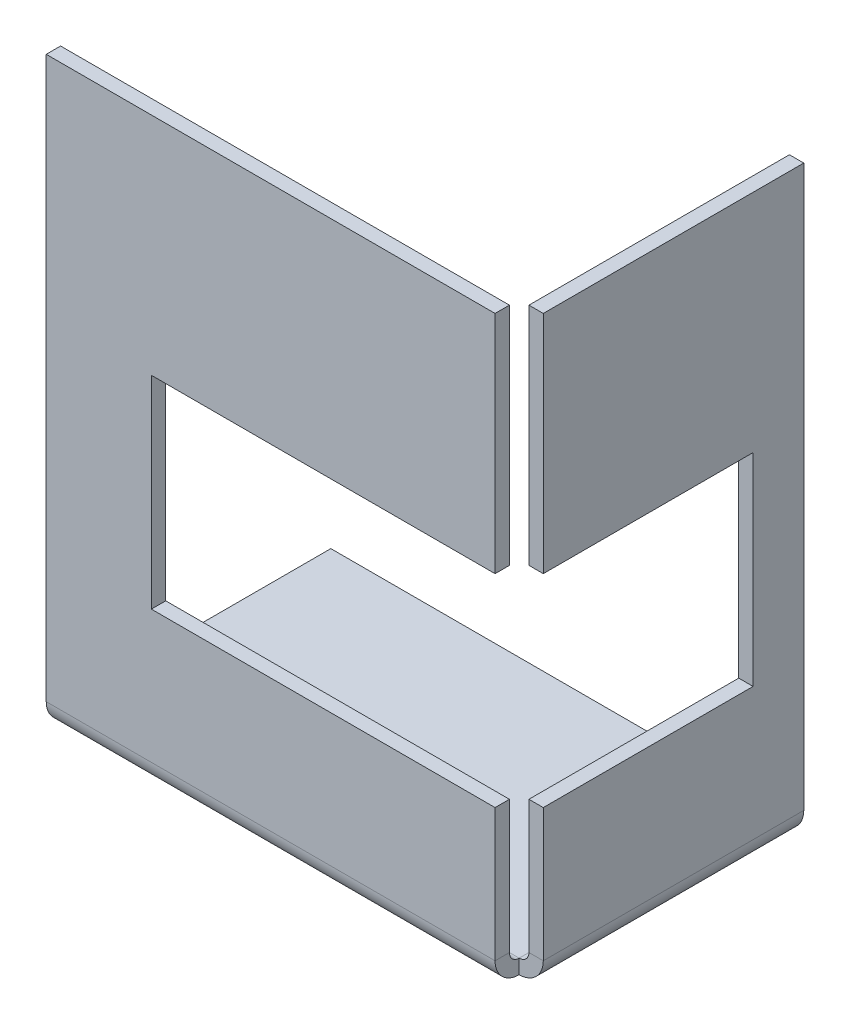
ISO-10303-21;
HEADER;
FILE_DESCRIPTION(('STEP AP214'),'2;1');
FILE_NAME('part.step','',(''),(''),'','','');
FILE_SCHEMA(('AUTOMOTIVE_DESIGN { 1 0 10303 214 1 1 1 1 }'));
ENDSEC;
DATA;
#1=APPLICATION_CONTEXT('core data for automotive mechanical design processes');
#2=APPLICATION_PROTOCOL_DEFINITION('international standard','automotive_design',2000,#1);
#3=PRODUCT_CONTEXT('',#1,'mechanical');
#4=PRODUCT('Part','Part','',(#3));
#5=PRODUCT_RELATED_PRODUCT_CATEGORY('part','',(#4));
#6=PRODUCT_DEFINITION_FORMATION('','',#4);
#7=PRODUCT_DEFINITION_CONTEXT('part definition',#1,'design');
#8=PRODUCT_DEFINITION('design','',#6,#7);
#9=PRODUCT_DEFINITION_SHAPE('','',#8);
#10=(LENGTH_UNIT() NAMED_UNIT(*) SI_UNIT(.MILLI.,.METRE.));
#11=(NAMED_UNIT(*) PLANE_ANGLE_UNIT() SI_UNIT($,.RADIAN.));
#12=(NAMED_UNIT(*) SI_UNIT($,.STERADIAN.) SOLID_ANGLE_UNIT());
#13=UNCERTAINTY_MEASURE_WITH_UNIT(LENGTH_MEASURE(1.E-05),#10,'distance_accuracy_value','');
#14=(GEOMETRIC_REPRESENTATION_CONTEXT(3) GLOBAL_UNCERTAINTY_ASSIGNED_CONTEXT((#13)) GLOBAL_UNIT_ASSIGNED_CONTEXT((#10,
#11,#12)) REPRESENTATION_CONTEXT('',''));
#15=CARTESIAN_POINT('',(0.,0.,0.));
#16=DIRECTION('',(0.,0.,1.));
#17=DIRECTION('',(1.,0.,0.));
#18=AXIS2_PLACEMENT_3D('',#15,#16,#17);
#19=CARTESIAN_POINT('',(23.0274150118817,29.2634,1.2366));
#20=DIRECTION('',(-1.,0.,0.));
#21=DIRECTION('',(0.,0.,1.));
#22=AXIS2_PLACEMENT_3D('',#19,#20,#21);
#23=PLANE('',#22);
#24=DIRECTION('',(0.,1.,0.));
#25=VECTOR('',#24,1.);
#26=CARTESIAN_POINT('',(23.0274150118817,29.2634,1.2366));
#27=LINE('',#26,#25);
#28=CARTESIAN_POINT('',(23.0274150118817,17.6997626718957,1.2366));
#29=VERTEX_POINT('',#28);
#30=CARTESIAN_POINT('',(23.0274150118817,29.2634,1.2366));
#31=VERTEX_POINT('',#30);
#32=EDGE_CURVE('E237',#29,#31,#27,.T.);
#33=ORIENTED_EDGE('',*,*,#32,.F.);
#34=DIRECTION('',(0.,0.,-1.));
#35=VECTOR('',#34,1.);
#36=CARTESIAN_POINT('',(23.0274150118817,17.6997626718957,1.2366));
#37=LINE('',#36,#35);
#38=CARTESIAN_POINT('',(23.0274150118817,17.6997626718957,0.499999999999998));
#39=VERTEX_POINT('',#38);
#40=EDGE_CURVE('E261',#29,#39,#37,.T.);
#41=ORIENTED_EDGE('',*,*,#40,.T.);
#42=DIRECTION('',(0.,-1.,0.));
#43=VECTOR('',#42,1.);
#44=CARTESIAN_POINT('',(23.0274150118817,29.2634,0.499999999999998));
#45=LINE('',#44,#43);
#46=CARTESIAN_POINT('',(23.0274150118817,29.2634,0.499999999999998));
#47=VERTEX_POINT('',#46);
#48=EDGE_CURVE('E248',#39,#47,#45,.F.);
#49=ORIENTED_EDGE('',*,*,#48,.T.);
#50=DIRECTION('',(0.,0.,-1.));
#51=VECTOR('',#50,1.);
#52=CARTESIAN_POINT('',(23.0274150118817,29.2634,1.2366));
#53=LINE('',#52,#51);
#54=EDGE_CURVE('E275',#31,#47,#53,.T.);
#55=ORIENTED_EDGE('',*,*,#54,.F.);
#56=EDGE_LOOP('',(#33,#41,#49,#55));
#57=FACE_BOUND('',#56,.T.);
#58=ADVANCED_FACE('F74',(#57),#23,.F.);
#59=CARTESIAN_POINT('',(24.2640150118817,0.,0.));
#60=DIRECTION('',(0.,0.,-1.));
#61=DIRECTION('',(-1.,0.,0.));
#62=AXIS2_PLACEMENT_3D('',#59,#60,#61);
#63=PLANE('',#62);
#64=DIRECTION('',(0.,-1.,0.));
#65=VECTOR('',#64,1.);
#66=CARTESIAN_POINT('',(24.2640150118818,29.2634,0.));
#67=LINE('',#66,#65);
#68=CARTESIAN_POINT('',(24.2640150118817,7.30900522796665,0.));
#69=VERTEX_POINT('',#68);
#70=CARTESIAN_POINT('',(24.2640150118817,0.499999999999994,0.));
#71=VERTEX_POINT('',#70);
#72=EDGE_CURVE('E314',#69,#71,#67,.T.);
#73=ORIENTED_EDGE('',*,*,#72,.F.);
#74=DIRECTION('',(-1.,0.,0.));
#75=VECTOR('',#74,1.);
#76=CARTESIAN_POINT('',(33.5274150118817,7.30900522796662,0.));
#77=LINE('',#76,#75);
#78=CARTESIAN_POINT('',(23.5274150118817,7.30900522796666,0.));
#79=VERTEX_POINT('',#78);
#80=EDGE_CURVE('E282',#69,#79,#77,.T.);
#81=ORIENTED_EDGE('',*,*,#80,.T.);
#82=DIRECTION('',(0.,1.,0.));
#83=VECTOR('',#82,1.);
#84=CARTESIAN_POINT('',(23.5274150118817,0.,0.));
#85=LINE('',#84,#83);
#86=CARTESIAN_POINT('',(23.5274150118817,0.499999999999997,0.));
#87=VERTEX_POINT('',#86);
#88=EDGE_CURVE('E322',#79,#87,#85,.F.);
#89=ORIENTED_EDGE('',*,*,#88,.T.);
#90=DIRECTION('',(-1.,0.,0.));
#91=VECTOR('',#90,1.);
#92=CARTESIAN_POINT('',(24.2640150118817,0.499999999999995,0.));
#93=LINE('',#92,#91);
#94=EDGE_CURVE('E299',#87,#71,#93,.F.);
#95=ORIENTED_EDGE('',*,*,#94,.T.);
#96=EDGE_LOOP('',(#73,#81,#89,#95));
#97=FACE_BOUND('',#96,.T.);
#98=ADVANCED_FACE('F469',(#97),#63,.F.);
#99=CARTESIAN_POINT('',(0.,-0.7366,0.));
#100=DIRECTION('',(-1.,0.,0.));
#101=DIRECTION('',(0.,0.,1.));
#102=AXIS2_PLACEMENT_3D('',#99,#100,#101);
#103=PLANE('',#102);
#104=DIRECTION('',(0.,0.,1.));
#105=VECTOR('',#104,1.);
#106=CARTESIAN_POINT('',(0.,0.,0.));
#107=LINE('',#106,#105);
#108=CARTESIAN_POINT('',(0.,0.,-13.364473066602));
#109=VERTEX_POINT('',#108);
#110=CARTESIAN_POINT('',(0.,0.,0.));
#111=VERTEX_POINT('',#110);
#112=EDGE_CURVE('E336',#109,#111,#107,.T.);
#113=ORIENTED_EDGE('',*,*,#112,.F.);
#114=DIRECTION('',(0.,1.,0.));
#115=VECTOR('',#114,1.);
#116=CARTESIAN_POINT('',(0.,-0.7366,-13.364473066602));
#117=LINE('',#116,#115);
#118=CARTESIAN_POINT('',(0.,-0.7366,-13.364473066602));
#119=VERTEX_POINT('',#118);
#120=EDGE_CURVE('E13',#119,#109,#117,.T.);
#121=ORIENTED_EDGE('',*,*,#120,.F.);
#122=DIRECTION('',(0.,0.,1.));
#123=VECTOR('',#122,1.);
#124=CARTESIAN_POINT('',(0.,-0.7366,0.));
#125=LINE('',#124,#123);
#126=CARTESIAN_POINT('',(0.,-0.7366,0.));
#127=VERTEX_POINT('',#126);
#128=EDGE_CURVE('E345',#119,#127,#125,.T.);
#129=ORIENTED_EDGE('',*,*,#128,.T.);
#130=DIRECTION('',(0.,1.,0.));
#131=VECTOR('',#130,1.);
#132=CARTESIAN_POINT('',(0.,-0.7366,0.));
#133=LINE('',#132,#131);
#134=EDGE_CURVE('E78',#127,#111,#133,.T.);
#135=ORIENTED_EDGE('',*,*,#134,.T.);
#136=EDGE_LOOP('',(#113,#121,#129,#135));
#137=FACE_BOUND('',#136,.T.);
#138=ADVANCED_FACE('F76',(#137),#103,.T.);
#139=CARTESIAN_POINT('',(0.,-0.7366,-13.364473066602));
#140=DIRECTION('',(0.,0.,-1.));
#141=DIRECTION('',(-1.,0.,0.));
#142=AXIS2_PLACEMENT_3D('',#139,#140,#141);
#143=PLANE('',#142);
#144=DIRECTION('',(-1.,0.,0.));
#145=VECTOR('',#144,1.);
#146=CARTESIAN_POINT('',(0.,0.,-13.364473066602));
#147=LINE('',#146,#145);
#148=CARTESIAN_POINT('',(23.0274150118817,0.,-13.364473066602));
#149=VERTEX_POINT('',#148);
#150=EDGE_CURVE('E349',#149,#109,#147,.T.);
#151=ORIENTED_EDGE('',*,*,#150,.F.);
#152=DIRECTION('',(0.,1.,0.));
#153=VECTOR('',#152,1.);
#154=CARTESIAN_POINT('',(23.0274150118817,-0.7366,-13.364473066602));
#155=LINE('',#154,#153);
#156=CARTESIAN_POINT('',(23.0274150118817,-0.736600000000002,-13.364473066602));
#157=VERTEX_POINT('',#156);
#158=EDGE_CURVE('E83',#157,#149,#155,.T.);
#159=ORIENTED_EDGE('',*,*,#158,.F.);
#160=DIRECTION('',(-1.,0.,0.));
#161=VECTOR('',#160,1.);
#162=CARTESIAN_POINT('',(0.,-0.7366,-13.364473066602));
#163=LINE('',#162,#161);
#164=EDGE_CURVE('E355',#157,#119,#163,.T.);
#165=ORIENTED_EDGE('',*,*,#164,.T.);
#166=ORIENTED_EDGE('',*,*,#120,.T.);
#167=EDGE_LOOP('',(#151,#159,#165,#166));
#168=FACE_BOUND('',#167,.T.);
#169=ADVANCED_FACE('F725',(#168),#143,.T.);
#170=CARTESIAN_POINT('',(0.,-0.7366,-13.364473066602));
#171=DIRECTION('',(0.,-1.,0.));
#172=DIRECTION('',(0.,0.,-1.));
#173=AXIS2_PLACEMENT_3D('',#170,#171,#172);
#174=PLANE('',#173);
#175=ORIENTED_EDGE('',*,*,#128,.F.);
#176=ORIENTED_EDGE('',*,*,#164,.F.);
#177=DIRECTION('',(0.,0.,-1.));
#178=VECTOR('',#177,1.);
#179=CARTESIAN_POINT('',(23.0274150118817,-0.7366,0.));
#180=LINE('',#179,#178);
#181=CARTESIAN_POINT('',(23.0274150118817,-0.7366,0.));
#182=VERTEX_POINT('',#181);
#183=EDGE_CURVE('E352',#182,#157,#180,.T.);
#184=ORIENTED_EDGE('',*,*,#183,.F.);
#185=DIRECTION('',(1.,0.,0.));
#186=VECTOR('',#185,1.);
#187=CARTESIAN_POINT('',(0.,-0.7366,0.));
#188=LINE('',#187,#186);
#189=EDGE_CURVE('E348',#127,#182,#188,.T.);
#190=ORIENTED_EDGE('',*,*,#189,.F.);
#191=EDGE_LOOP('',(#175,#176,#184,#190));
#192=FACE_BOUND('',#191,.T.);
#193=ADVANCED_FACE('F432',(#192),#174,.T.);
#194=CARTESIAN_POINT('',(0.,0.,-13.364473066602));
#195=DIRECTION('',(0.,-1.,0.));
#196=DIRECTION('',(0.,0.,-1.));
#197=AXIS2_PLACEMENT_3D('',#194,#195,#196);
#198=PLANE('',#197);
#199=ORIENTED_EDGE('',*,*,#112,.T.);
#200=DIRECTION('',(1.,0.,0.));
#201=VECTOR('',#200,1.);
#202=CARTESIAN_POINT('',(0.,0.,0.));
#203=LINE('',#202,#201);
#204=CARTESIAN_POINT('',(23.0274150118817,0.,0.));
#205=VERTEX_POINT('',#204);
#206=EDGE_CURVE('E360',#111,#205,#203,.T.);
#207=ORIENTED_EDGE('',*,*,#206,.T.);
#208=DIRECTION('',(0.,0.,-1.));
#209=VECTOR('',#208,1.);
#210=CARTESIAN_POINT('',(23.0274150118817,0.,0.));
#211=LINE('',#210,#209);
#212=EDGE_CURVE('E362',#205,#149,#211,.T.);
#213=ORIENTED_EDGE('',*,*,#212,.T.);
#214=ORIENTED_EDGE('',*,*,#150,.T.);
#215=EDGE_LOOP('',(#199,#207,#213,#214));
#216=FACE_BOUND('',#215,.T.);
#217=ADVANCED_FACE('F381',(#216),#198,.F.);
#218=CARTESIAN_POINT('',(23.0274150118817,0.499999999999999,0.));
#219=DIRECTION('',(0.,0.,1.));
#220=DIRECTION('',(1.,0.,0.));
#221=AXIS2_PLACEMENT_3D('',#218,#219,#220);
#222=PLANE('',#221);
#223=ORIENTED_EDGE('',*,*,#94,.F.);
#224=CARTESIAN_POINT('',(23.0274150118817,0.499999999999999,0.));
#225=DIRECTION('',(0.,0.,-1.));
#226=DIRECTION('',(-1.,0.,0.));
#227=AXIS2_PLACEMENT_3D('',#224,#225,#226);
#228=CIRCLE('',#227,0.5);
#229=EDGE_CURVE('E340',#205,#87,#228,.F.);
#230=ORIENTED_EDGE('',*,*,#229,.F.);
#231=DIRECTION('',(0.,1.,0.));
#232=VECTOR('',#231,1.);
#233=CARTESIAN_POINT('',(23.0274150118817,-0.7366,0.));
#234=LINE('',#233,#232);
#235=EDGE_CURVE('E367',#182,#205,#234,.T.);
#236=ORIENTED_EDGE('',*,*,#235,.F.);
#237=CARTESIAN_POINT('',(23.0274150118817,0.499999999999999,0.));
#238=DIRECTION('',(0.,0.,-1.));
#239=DIRECTION('',(-1.,0.,0.));
#240=AXIS2_PLACEMENT_3D('',#237,#238,#239);
#241=CIRCLE('',#240,1.2366);
#242=EDGE_CURVE('E333',#182,#71,#241,.F.);
#243=ORIENTED_EDGE('',*,*,#242,.T.);
#244=EDGE_LOOP('',(#223,#230,#236,#243));
#245=FACE_BOUND('',#244,.T.);
#246=ADVANCED_FACE('F474',(#245),#222,.T.);
#247=CARTESIAN_POINT('',(23.0274150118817,0.499999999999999,-13.364473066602));
#248=DIRECTION('',(0.,0.,1.));
#249=DIRECTION('',(1.,0.,0.));
#250=AXIS2_PLACEMENT_3D('',#247,#248,#249);
#251=PLANE('',#250);
#252=CARTESIAN_POINT('',(23.0274150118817,0.499999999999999,-13.364473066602));
#253=DIRECTION('',(0.,0.,-1.));
#254=DIRECTION('',(-1.,0.,0.));
#255=AXIS2_PLACEMENT_3D('',#252,#253,#254);
#256=CIRCLE('',#255,0.5);
#257=CARTESIAN_POINT('',(23.5274150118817,0.499999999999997,-13.364473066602));
#258=VERTEX_POINT('',#257);
#259=EDGE_CURVE('E303',#258,#149,#256,.T.);
#260=ORIENTED_EDGE('',*,*,#259,.F.);
#261=DIRECTION('',(-1.,0.,0.));
#262=VECTOR('',#261,1.);
#263=CARTESIAN_POINT('',(23.5274150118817,0.499999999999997,-13.364473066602));
#264=LINE('',#263,#262);
#265=CARTESIAN_POINT('',(24.2640150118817,0.499999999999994,-13.364473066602));
#266=VERTEX_POINT('',#265);
#267=EDGE_CURVE('E326',#258,#266,#264,.F.);
#268=ORIENTED_EDGE('',*,*,#267,.T.);
#269=CARTESIAN_POINT('',(23.0274150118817,0.499999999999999,-13.364473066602));
#270=DIRECTION('',(0.,0.,-1.));
#271=DIRECTION('',(-1.,0.,0.));
#272=AXIS2_PLACEMENT_3D('',#269,#270,#271);
#273=CIRCLE('',#272,1.2366);
#274=EDGE_CURVE('E337',#266,#157,#273,.T.);
#275=ORIENTED_EDGE('',*,*,#274,.T.);
#276=ORIENTED_EDGE('',*,*,#158,.T.);
#277=EDGE_LOOP('',(#260,#268,#275,#276));
#278=FACE_BOUND('',#277,.T.);
#279=ADVANCED_FACE('F438',(#278),#251,.F.);
#280=CARTESIAN_POINT('',(23.0274150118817,0.499999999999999,-13.364473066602));
#281=DIRECTION('',(0.,0.,-1.));
#282=DIRECTION('',(1.,0.,0.));
#283=AXIS2_PLACEMENT_3D('',#280,#281,#282);
#284=CYLINDRICAL_SURFACE('',#283,1.2366);
#285=ORIENTED_EDGE('',*,*,#183,.T.);
#286=ORIENTED_EDGE('',*,*,#274,.F.);
#287=DIRECTION('',(0.,0.,-1.));
#288=VECTOR('',#287,1.);
#289=CARTESIAN_POINT('',(24.2640150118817,0.499999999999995,0.));
#290=LINE('',#289,#288);
#291=EDGE_CURVE('E323',#266,#71,#290,.F.);
#292=ORIENTED_EDGE('',*,*,#291,.T.);
#293=ORIENTED_EDGE('',*,*,#242,.F.);
#294=EDGE_LOOP('',(#285,#286,#292,#293));
#295=FACE_BOUND('',#294,.T.);
#296=ADVANCED_FACE('F435',(#295),#284,.T.);
#297=CARTESIAN_POINT('',(23.0274150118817,0.499999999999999,-13.364473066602));
#298=DIRECTION('',(0.,0.,-1.));
#299=DIRECTION('',(1.,0.,0.));
#300=AXIS2_PLACEMENT_3D('',#297,#298,#299);
#301=CYLINDRICAL_SURFACE('',#300,0.5);
#302=ORIENTED_EDGE('',*,*,#212,.F.);
#303=ORIENTED_EDGE('',*,*,#229,.T.);
#304=DIRECTION('',(0.,0.,-1.));
#305=VECTOR('',#304,1.);
#306=CARTESIAN_POINT('',(23.5274150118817,0.499999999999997,0.));
#307=LINE('',#306,#305);
#308=EDGE_CURVE('E329',#87,#258,#307,.T.);
#309=ORIENTED_EDGE('',*,*,#308,.T.);
#310=ORIENTED_EDGE('',*,*,#259,.T.);
#311=EDGE_LOOP('',(#302,#303,#309,#310));
#312=FACE_BOUND('',#311,.T.);
#313=ADVANCED_FACE('F477',(#312),#301,.F.);
#314=CARTESIAN_POINT('',(23.5274150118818,29.2634,0.));
#315=VERTEX_POINT('',#314);
#316=CARTESIAN_POINT('',(23.5274150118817,17.6997626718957,0.));
#317=VERTEX_POINT('',#316);
#318=EDGE_CURVE('E319',#315,#317,#85,.F.);
#319=ORIENTED_EDGE('',*,*,#318,.T.);
#320=DIRECTION('',(-1.,0.,0.));
#321=VECTOR('',#320,1.);
#322=CARTESIAN_POINT('',(33.5274150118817,17.6997626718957,0.));
#323=LINE('',#322,#321);
#324=CARTESIAN_POINT('',(24.2640150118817,17.6997626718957,0.));
#325=VERTEX_POINT('',#324);
#326=EDGE_CURVE('E99',#325,#317,#323,.T.);
#327=ORIENTED_EDGE('',*,*,#326,.F.);
#328=CARTESIAN_POINT('',(24.2640150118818,29.2634,0.));
#329=VERTEX_POINT('',#328);
#330=EDGE_CURVE('E311',#329,#325,#67,.T.);
#331=ORIENTED_EDGE('',*,*,#330,.F.);
#332=DIRECTION('',(-1.,0.,0.));
#333=VECTOR('',#332,1.);
#334=CARTESIAN_POINT('',(24.2640150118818,29.2634,0.));
#335=LINE('',#334,#333);
#336=EDGE_CURVE('E304',#329,#315,#335,.T.);
#337=ORIENTED_EDGE('',*,*,#336,.T.);
#338=EDGE_LOOP('',(#319,#327,#331,#337));
#339=FACE_BOUND('',#338,.T.);
#340=ADVANCED_FACE('F456',(#339),#63,.F.);
#341=CARTESIAN_POINT('',(24.2640150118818,29.2634,-13.364473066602));
#342=DIRECTION('',(0.,0.,1.));
#343=DIRECTION('',(0.,-1.,0.));
#344=AXIS2_PLACEMENT_3D('',#341,#342,#343);
#345=PLANE('',#344);
#346=ORIENTED_EDGE('',*,*,#267,.F.);
#347=DIRECTION('',(0.,-1.,0.));
#348=VECTOR('',#347,1.);
#349=CARTESIAN_POINT('',(23.5274150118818,29.2634,-13.364473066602));
#350=LINE('',#349,#348);
#351=CARTESIAN_POINT('',(23.5274150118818,29.2634,-13.364473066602));
#352=VERTEX_POINT('',#351);
#353=EDGE_CURVE('E317',#258,#352,#350,.F.);
#354=ORIENTED_EDGE('',*,*,#353,.T.);
#355=DIRECTION('',(-1.,0.,0.));
#356=VECTOR('',#355,1.);
#357=CARTESIAN_POINT('',(24.2640150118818,29.2634,-13.364473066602));
#358=LINE('',#357,#356);
#359=CARTESIAN_POINT('',(24.2640150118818,29.2634,-13.364473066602));
#360=VERTEX_POINT('',#359);
#361=EDGE_CURVE('E300',#360,#352,#358,.T.);
#362=ORIENTED_EDGE('',*,*,#361,.F.);
#363=DIRECTION('',(0.,1.,0.));
#364=VECTOR('',#363,1.);
#365=CARTESIAN_POINT('',(24.2640150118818,29.2634,-13.364473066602));
#366=LINE('',#365,#364);
#367=EDGE_CURVE('E309',#266,#360,#366,.T.);
#368=ORIENTED_EDGE('',*,*,#367,.F.);
#369=EDGE_LOOP('',(#346,#354,#362,#368));
#370=FACE_BOUND('',#369,.T.);
#371=ADVANCED_FACE('F448',(#370),#345,.F.);
#372=CARTESIAN_POINT('',(24.2640150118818,29.2634,0.));
#373=DIRECTION('',(-1.,0.,0.));
#374=DIRECTION('',(0.,-1.,0.));
#375=AXIS2_PLACEMENT_3D('',#372,#373,#374);
#376=PLANE('',#375);
#377=DIRECTION('',(0.,-1.,0.));
#378=VECTOR('',#377,1.);
#379=CARTESIAN_POINT('',(24.2640150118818,29.2634,-10.764485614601));
#380=LINE('',#379,#378);
#381=CARTESIAN_POINT('',(24.2640150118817,17.6997626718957,-10.764485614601));
#382=VERTEX_POINT('',#381);
#383=CARTESIAN_POINT('',(24.2640150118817,7.30900522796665,-10.764485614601));
#384=VERTEX_POINT('',#383);
#385=EDGE_CURVE('E293',#382,#384,#380,.T.);
#386=ORIENTED_EDGE('',*,*,#385,.T.);
#387=DIRECTION('',(0.,0.,1.));
#388=VECTOR('',#387,1.);
#389=CARTESIAN_POINT('',(24.2640150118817,7.30900522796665,0.));
#390=LINE('',#389,#388);
#391=EDGE_CURVE('E296',#384,#69,#390,.T.);
#392=ORIENTED_EDGE('',*,*,#391,.T.);
#393=ORIENTED_EDGE('',*,*,#72,.T.);
#394=ORIENTED_EDGE('',*,*,#291,.F.);
#395=ORIENTED_EDGE('',*,*,#367,.T.);
#396=DIRECTION('',(0.,0.,1.));
#397=VECTOR('',#396,1.);
#398=CARTESIAN_POINT('',(24.2640150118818,29.2634,0.));
#399=LINE('',#398,#397);
#400=EDGE_CURVE('E307',#360,#329,#399,.T.);
#401=ORIENTED_EDGE('',*,*,#400,.T.);
#402=ORIENTED_EDGE('',*,*,#330,.T.);
#403=DIRECTION('',(0.,0.,-1.));
#404=VECTOR('',#403,1.);
#405=CARTESIAN_POINT('',(24.2640150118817,17.6997626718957,0.));
#406=LINE('',#405,#404);
#407=EDGE_CURVE('E285',#325,#382,#406,.T.);
#408=ORIENTED_EDGE('',*,*,#407,.T.);
#409=EDGE_LOOP('',(#386,#392,#393,#394,#395,#401,#402,#408));
#410=FACE_BOUND('',#409,.T.);
#411=ADVANCED_FACE('F445',(#410),#376,.F.);
#412=CARTESIAN_POINT('',(23.5274150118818,29.2634,0.));
#413=DIRECTION('',(-1.,0.,0.));
#414=DIRECTION('',(0.,-1.,0.));
#415=AXIS2_PLACEMENT_3D('',#412,#413,#414);
#416=PLANE('',#415);
#417=DIRECTION('',(0.,0.,1.));
#418=VECTOR('',#417,1.);
#419=CARTESIAN_POINT('',(23.5274150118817,7.30900522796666,0.));
#420=LINE('',#419,#418);
#421=CARTESIAN_POINT('',(23.5274150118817,7.30900522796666,-10.764485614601));
#422=VERTEX_POINT('',#421);
#423=EDGE_CURVE('E280',#422,#79,#420,.T.);
#424=ORIENTED_EDGE('',*,*,#423,.F.);
#425=DIRECTION('',(0.,-1.,0.));
#426=VECTOR('',#425,1.);
#427=CARTESIAN_POINT('',(23.5274150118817,7.30900522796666,-10.764485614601));
#428=LINE('',#427,#426);
#429=CARTESIAN_POINT('',(23.5274150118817,17.6997626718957,-10.764485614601));
#430=VERTEX_POINT('',#429);
#431=EDGE_CURVE('E277',#430,#422,#428,.T.);
#432=ORIENTED_EDGE('',*,*,#431,.F.);
#433=DIRECTION('',(0.,0.,-1.));
#434=VECTOR('',#433,1.);
#435=CARTESIAN_POINT('',(23.5274150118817,17.6997626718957,0.));
#436=LINE('',#435,#434);
#437=EDGE_CURVE('E265',#317,#430,#436,.T.);
#438=ORIENTED_EDGE('',*,*,#437,.F.);
#439=ORIENTED_EDGE('',*,*,#318,.F.);
#440=DIRECTION('',(0.,0.,-1.));
#441=VECTOR('',#440,1.);
#442=CARTESIAN_POINT('',(23.5274150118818,29.2634,0.));
#443=LINE('',#442,#441);
#444=EDGE_CURVE('E315',#352,#315,#443,.F.);
#445=ORIENTED_EDGE('',*,*,#444,.F.);
#446=ORIENTED_EDGE('',*,*,#353,.F.);
#447=ORIENTED_EDGE('',*,*,#308,.F.);
#448=ORIENTED_EDGE('',*,*,#88,.F.);
#449=EDGE_LOOP('',(#424,#432,#438,#439,#445,#446,#447,#448));
#450=FACE_BOUND('',#449,.T.);
#451=ADVANCED_FACE('F460',(#450),#416,.T.);
#452=CARTESIAN_POINT('',(24.2640150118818,29.2634,0.));
#453=DIRECTION('',(0.,-1.,0.));
#454=DIRECTION('',(1.,0.,0.));
#455=AXIS2_PLACEMENT_3D('',#452,#453,#454);
#456=PLANE('',#455);
#457=ORIENTED_EDGE('',*,*,#444,.T.);
#458=ORIENTED_EDGE('',*,*,#336,.F.);
#459=ORIENTED_EDGE('',*,*,#400,.F.);
#460=ORIENTED_EDGE('',*,*,#361,.T.);
#461=EDGE_LOOP('',(#457,#458,#459,#460));
#462=FACE_BOUND('',#461,.T.);
#463=ADVANCED_FACE('F453',(#462),#456,.F.);
#464=CARTESIAN_POINT('',(33.5274150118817,7.30900522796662,0.));
#465=DIRECTION('',(0.,-1.,0.));
#466=DIRECTION('',(1.,0.,0.));
#467=AXIS2_PLACEMENT_3D('',#464,#465,#466);
#468=PLANE('',#467);
#469=DIRECTION('',(-1.,0.,0.));
#470=VECTOR('',#469,1.);
#471=CARTESIAN_POINT('',(33.5274150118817,7.30900522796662,-10.764485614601));
#472=LINE('',#471,#470);
#473=EDGE_CURVE('E286',#384,#422,#472,.T.);
#474=ORIENTED_EDGE('',*,*,#473,.T.);
#475=ORIENTED_EDGE('',*,*,#423,.T.);
#476=ORIENTED_EDGE('',*,*,#80,.F.);
#477=ORIENTED_EDGE('',*,*,#391,.F.);
#478=EDGE_LOOP('',(#474,#475,#476,#477));
#479=FACE_BOUND('',#478,.T.);
#480=ADVANCED_FACE('F478',(#479),#468,.F.);
#481=CARTESIAN_POINT('',(33.5274150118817,7.30900522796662,-10.764485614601));
#482=DIRECTION('',(0.,0.,-1.));
#483=DIRECTION('',(-1.,0.,0.));
#484=AXIS2_PLACEMENT_3D('',#481,#482,#483);
#485=PLANE('',#484);
#486=DIRECTION('',(-1.,0.,0.));
#487=VECTOR('',#486,1.);
#488=CARTESIAN_POINT('',(33.5274150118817,17.6997626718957,-10.764485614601));
#489=LINE('',#488,#487);
#490=EDGE_CURVE('E288',#382,#430,#489,.T.);
#491=ORIENTED_EDGE('',*,*,#490,.T.);
#492=ORIENTED_EDGE('',*,*,#431,.T.);
#493=ORIENTED_EDGE('',*,*,#473,.F.);
#494=ORIENTED_EDGE('',*,*,#385,.F.);
#495=EDGE_LOOP('',(#491,#492,#493,#494));
#496=FACE_BOUND('',#495,.T.);
#497=ADVANCED_FACE('F465',(#496),#485,.F.);
#498=CARTESIAN_POINT('',(33.5274150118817,17.6997626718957,0.));
#499=DIRECTION('',(0.,1.,0.));
#500=DIRECTION('',(-1.,0.,0.));
#501=AXIS2_PLACEMENT_3D('',#498,#499,#500);
#502=PLANE('',#501);
#503=ORIENTED_EDGE('',*,*,#326,.T.);
#504=ORIENTED_EDGE('',*,*,#437,.T.);
#505=ORIENTED_EDGE('',*,*,#490,.F.);
#506=ORIENTED_EDGE('',*,*,#407,.F.);
#507=EDGE_LOOP('',(#503,#504,#505,#506));
#508=FACE_BOUND('',#507,.T.);
#509=ADVANCED_FACE('F463',(#508),#502,.F.);
#510=CARTESIAN_POINT('',(0.,0.499999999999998,0.));
#511=DIRECTION('',(-1.,0.,0.));
#512=DIRECTION('',(0.,0.,1.));
#513=AXIS2_PLACEMENT_3D('',#510,#511,#512);
#514=PLANE('',#513);
#515=DIRECTION('',(0.,0.,-1.));
#516=VECTOR('',#515,1.);
#517=CARTESIAN_POINT('',(0.,0.499999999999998,1.2366));
#518=LINE('',#517,#516);
#519=CARTESIAN_POINT('',(0.,0.499999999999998,0.499999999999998));
#520=VERTEX_POINT('',#519);
#521=CARTESIAN_POINT('',(0.,0.499999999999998,1.2366));
#522=VERTEX_POINT('',#521);
#523=EDGE_CURVE('E258',#520,#522,#518,.F.);
#524=ORIENTED_EDGE('',*,*,#523,.F.);
#525=CARTESIAN_POINT('',(0.,0.499999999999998,0.));
#526=DIRECTION('',(1.,0.,0.));
#527=DIRECTION('',(0.,0.,-1.));
#528=AXIS2_PLACEMENT_3D('',#525,#526,#527);
#529=CIRCLE('',#528,0.499999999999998);
#530=EDGE_CURVE('E269',#111,#520,#529,.F.);
#531=ORIENTED_EDGE('',*,*,#530,.F.);
#532=ORIENTED_EDGE('',*,*,#134,.F.);
#533=CARTESIAN_POINT('',(0.,0.499999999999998,0.));
#534=DIRECTION('',(1.,0.,0.));
#535=DIRECTION('',(0.,0.,-1.));
#536=AXIS2_PLACEMENT_3D('',#533,#534,#535);
#537=CIRCLE('',#536,1.2366);
#538=EDGE_CURVE('E262',#127,#522,#537,.F.);
#539=ORIENTED_EDGE('',*,*,#538,.T.);
#540=EDGE_LOOP('',(#524,#531,#532,#539));
#541=FACE_BOUND('',#540,.T.);
#542=ADVANCED_FACE('F387',(#541),#514,.T.);
#543=CARTESIAN_POINT('',(23.0274150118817,0.499999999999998,0.));
#544=DIRECTION('',(-1.,0.,0.));
#545=DIRECTION('',(0.,0.,1.));
#546=AXIS2_PLACEMENT_3D('',#543,#544,#545);
#547=PLANE('',#546);
#548=CARTESIAN_POINT('',(23.0274150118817,0.499999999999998,0.));
#549=DIRECTION('',(1.,0.,0.));
#550=DIRECTION('',(0.,0.,-1.));
#551=AXIS2_PLACEMENT_3D('',#548,#549,#550);
#552=CIRCLE('',#551,0.499999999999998);
#553=CARTESIAN_POINT('',(23.0274150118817,0.499999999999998,0.499999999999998));
#554=VERTEX_POINT('',#553);
#555=EDGE_CURVE('E272',#554,#205,#552,.T.);
#556=ORIENTED_EDGE('',*,*,#555,.F.);
#557=DIRECTION('',(0.,0.,-1.));
#558=VECTOR('',#557,1.);
#559=CARTESIAN_POINT('',(23.0274150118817,0.499999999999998,0.5));
#560=LINE('',#559,#558);
#561=CARTESIAN_POINT('',(23.0274150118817,0.499999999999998,1.2366));
#562=VERTEX_POINT('',#561);
#563=EDGE_CURVE('E253',#554,#562,#560,.F.);
#564=ORIENTED_EDGE('',*,*,#563,.T.);
#565=CARTESIAN_POINT('',(23.0274150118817,0.499999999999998,0.));
#566=DIRECTION('',(1.,0.,0.));
#567=DIRECTION('',(0.,0.,-1.));
#568=AXIS2_PLACEMENT_3D('',#565,#566,#567);
#569=CIRCLE('',#568,1.2366);
#570=EDGE_CURVE('E266',#562,#182,#569,.T.);
#571=ORIENTED_EDGE('',*,*,#570,.T.);
#572=ORIENTED_EDGE('',*,*,#235,.T.);
#573=EDGE_LOOP('',(#556,#564,#571,#572));
#574=FACE_BOUND('',#573,.T.);
#575=ADVANCED_FACE('F427',(#574),#547,.F.);
#576=CARTESIAN_POINT('',(23.0274150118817,0.499999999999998,0.));
#577=DIRECTION('',(1.,0.,0.));
#578=DIRECTION('',(0.,0.,1.));
#579=AXIS2_PLACEMENT_3D('',#576,#577,#578);
#580=CYLINDRICAL_SURFACE('',#579,1.2366);
#581=ORIENTED_EDGE('',*,*,#189,.T.);
#582=ORIENTED_EDGE('',*,*,#570,.F.);
#583=DIRECTION('',(1.,0.,0.));
#584=VECTOR('',#583,1.);
#585=CARTESIAN_POINT('',(0.,0.499999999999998,1.2366));
#586=LINE('',#585,#584);
#587=EDGE_CURVE('E235',#562,#522,#586,.F.);
#588=ORIENTED_EDGE('',*,*,#587,.T.);
#589=ORIENTED_EDGE('',*,*,#538,.F.);
#590=EDGE_LOOP('',(#581,#582,#588,#589));
#591=FACE_BOUND('',#590,.T.);
#592=ADVANCED_FACE('F429',(#591),#580,.T.);
#593=CARTESIAN_POINT('',(23.0274150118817,0.499999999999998,0.));
#594=DIRECTION('',(1.,0.,0.));
#595=DIRECTION('',(0.,0.,1.));
#596=AXIS2_PLACEMENT_3D('',#593,#594,#595);
#597=CYLINDRICAL_SURFACE('',#596,0.499999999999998);
#598=ORIENTED_EDGE('',*,*,#206,.F.);
#599=ORIENTED_EDGE('',*,*,#530,.T.);
#600=DIRECTION('',(1.,0.,0.));
#601=VECTOR('',#600,1.);
#602=CARTESIAN_POINT('',(0.,0.499999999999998,0.499999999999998));
#603=LINE('',#602,#601);
#604=EDGE_CURVE('E256',#520,#554,#603,.T.);
#605=ORIENTED_EDGE('',*,*,#604,.T.);
#606=ORIENTED_EDGE('',*,*,#555,.T.);
#607=EDGE_LOOP('',(#598,#599,#605,#606));
#608=FACE_BOUND('',#607,.T.);
#609=ADVANCED_FACE('F385',(#608),#597,.F.);
#610=CARTESIAN_POINT('',(0.,0.,1.2366));
#611=DIRECTION('',(1.,0.,0.));
#612=DIRECTION('',(0.,0.,-1.));
#613=AXIS2_PLACEMENT_3D('',#610,#611,#612);
#614=PLANE('',#613);
#615=ORIENTED_EDGE('',*,*,#523,.T.);
#616=DIRECTION('',(0.,-1.,0.));
#617=VECTOR('',#616,1.);
#618=CARTESIAN_POINT('',(0.,29.2634,1.2366));
#619=LINE('',#618,#617);
#620=CARTESIAN_POINT('',(0.,29.2634,1.2366));
#621=VERTEX_POINT('',#620);
#622=EDGE_CURVE('E241',#621,#522,#619,.T.);
#623=ORIENTED_EDGE('',*,*,#622,.F.);
#624=DIRECTION('',(0.,0.,-1.));
#625=VECTOR('',#624,1.);
#626=CARTESIAN_POINT('',(0.,29.2634,1.2366));
#627=LINE('',#626,#625);
#628=CARTESIAN_POINT('',(0.,29.2634,0.499999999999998));
#629=VERTEX_POINT('',#628);
#630=EDGE_CURVE('E239',#621,#629,#627,.T.);
#631=ORIENTED_EDGE('',*,*,#630,.T.);
#632=DIRECTION('',(0.,1.,0.));
#633=VECTOR('',#632,1.);
#634=CARTESIAN_POINT('',(0.,0.,0.499999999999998));
#635=LINE('',#634,#633);
#636=EDGE_CURVE('E249',#629,#520,#635,.F.);
#637=ORIENTED_EDGE('',*,*,#636,.T.);
#638=EDGE_LOOP('',(#615,#623,#631,#637));
#639=FACE_BOUND('',#638,.T.);
#640=ADVANCED_FACE('F390',(#639),#614,.F.);
#641=CARTESIAN_POINT('',(23.0274150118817,7.30900522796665,0.499999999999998));
#642=VERTEX_POINT('',#641);
#643=EDGE_CURVE('E229',#554,#642,#45,.F.);
#644=ORIENTED_EDGE('',*,*,#643,.T.);
#645=DIRECTION('',(0.,0.,-1.));
#646=VECTOR('',#645,1.);
#647=CARTESIAN_POINT('',(23.0274150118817,7.30900522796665,1.2366));
#648=LINE('',#647,#646);
#649=CARTESIAN_POINT('',(23.0274150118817,7.30900522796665,1.2366));
#650=VERTEX_POINT('',#649);
#651=EDGE_CURVE('E91',#650,#642,#648,.T.);
#652=ORIENTED_EDGE('',*,*,#651,.F.);
#653=EDGE_CURVE('E227',#562,#650,#27,.T.);
#654=ORIENTED_EDGE('',*,*,#653,.F.);
#655=ORIENTED_EDGE('',*,*,#563,.F.);
#656=EDGE_LOOP('',(#644,#652,#654,#655));
#657=FACE_BOUND('',#656,.T.);
#658=ADVANCED_FACE('F225',(#657),#23,.F.);
#659=CARTESIAN_POINT('',(0.,29.2634,1.2366));
#660=DIRECTION('',(0.,0.,-1.));
#661=DIRECTION('',(-1.,0.,0.));
#662=AXIS2_PLACEMENT_3D('',#659,#660,#661);
#663=PLANE('',#662);
#664=DIRECTION('',(0.,1.,0.));
#665=VECTOR('',#664,1.);
#666=CARTESIAN_POINT('',(5.39403187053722,7.30900522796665,1.2366));
#667=LINE('',#666,#665);
#668=CARTESIAN_POINT('',(5.39403187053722,7.30900522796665,1.2366));
#669=VERTEX_POINT('',#668);
#670=CARTESIAN_POINT('',(5.39403187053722,17.6997626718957,1.2366));
#671=VERTEX_POINT('',#670);
#672=EDGE_CURVE('E219',#669,#671,#667,.T.);
#673=ORIENTED_EDGE('',*,*,#672,.T.);
#674=DIRECTION('',(1.,0.,0.));
#675=VECTOR('',#674,1.);
#676=CARTESIAN_POINT('',(23.0274150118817,17.6997626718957,1.2366));
#677=LINE('',#676,#675);
#678=EDGE_CURVE('E230',#671,#29,#677,.T.);
#679=ORIENTED_EDGE('',*,*,#678,.T.);
#680=ORIENTED_EDGE('',*,*,#32,.T.);
#681=DIRECTION('',(-1.,0.,0.));
#682=VECTOR('',#681,1.);
#683=CARTESIAN_POINT('',(0.,29.2634,1.2366));
#684=LINE('',#683,#682);
#685=EDGE_CURVE('E236',#31,#621,#684,.T.);
#686=ORIENTED_EDGE('',*,*,#685,.T.);
#687=ORIENTED_EDGE('',*,*,#622,.T.);
#688=ORIENTED_EDGE('',*,*,#587,.F.);
#689=ORIENTED_EDGE('',*,*,#653,.T.);
#690=DIRECTION('',(-1.,0.,0.));
#691=VECTOR('',#690,1.);
#692=CARTESIAN_POINT('',(23.0274150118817,7.30900522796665,1.2366));
#693=LINE('',#692,#691);
#694=EDGE_CURVE('E212',#650,#669,#693,.T.);
#695=ORIENTED_EDGE('',*,*,#694,.T.);
#696=EDGE_LOOP('',(#673,#679,#680,#686,#687,#688,#689,#695));
#697=FACE_BOUND('',#696,.T.);
#698=ADVANCED_FACE('F233',(#697),#663,.F.);
#699=CARTESIAN_POINT('',(0.,29.2634,0.499999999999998));
#700=DIRECTION('',(0.,0.,-1.));
#701=DIRECTION('',(-1.,0.,0.));
#702=AXIS2_PLACEMENT_3D('',#699,#700,#701);
#703=PLANE('',#702);
#704=DIRECTION('',(1.,0.,0.));
#705=VECTOR('',#704,1.);
#706=CARTESIAN_POINT('',(23.0274150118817,17.6997626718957,0.499999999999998));
#707=LINE('',#706,#705);
#708=CARTESIAN_POINT('',(5.39403187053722,17.6997626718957,0.499999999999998));
#709=VERTEX_POINT('',#708);
#710=EDGE_CURVE('E220',#709,#39,#707,.T.);
#711=ORIENTED_EDGE('',*,*,#710,.F.);
#712=DIRECTION('',(0.,1.,0.));
#713=VECTOR('',#712,1.);
#714=CARTESIAN_POINT('',(5.39403187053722,7.30900522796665,0.499999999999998));
#715=LINE('',#714,#713);
#716=CARTESIAN_POINT('',(5.39403187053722,7.30900522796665,0.499999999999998));
#717=VERTEX_POINT('',#716);
#718=EDGE_CURVE('E410',#717,#709,#715,.T.);
#719=ORIENTED_EDGE('',*,*,#718,.F.);
#720=DIRECTION('',(-1.,0.,0.));
#721=VECTOR('',#720,1.);
#722=CARTESIAN_POINT('',(23.0274150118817,7.30900522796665,0.499999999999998));
#723=LINE('',#722,#721);
#724=EDGE_CURVE('E413',#642,#717,#723,.T.);
#725=ORIENTED_EDGE('',*,*,#724,.F.);
#726=ORIENTED_EDGE('',*,*,#643,.F.);
#727=ORIENTED_EDGE('',*,*,#604,.F.);
#728=ORIENTED_EDGE('',*,*,#636,.F.);
#729=DIRECTION('',(1.,0.,0.));
#730=VECTOR('',#729,1.);
#731=CARTESIAN_POINT('',(0.,29.2634,0.499999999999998));
#732=LINE('',#731,#730);
#733=EDGE_CURVE('E245',#47,#629,#732,.F.);
#734=ORIENTED_EDGE('',*,*,#733,.F.);
#735=ORIENTED_EDGE('',*,*,#48,.F.);
#736=EDGE_LOOP('',(#711,#719,#725,#726,#727,#728,#734,#735));
#737=FACE_BOUND('',#736,.T.);
#738=ADVANCED_FACE('F426',(#737),#703,.T.);
#739=CARTESIAN_POINT('',(0.,29.2634,1.2366));
#740=DIRECTION('',(0.,-1.,0.));
#741=DIRECTION('',(0.,0.,-1.));
#742=AXIS2_PLACEMENT_3D('',#739,#740,#741);
#743=PLANE('',#742);
#744=ORIENTED_EDGE('',*,*,#733,.T.);
#745=ORIENTED_EDGE('',*,*,#630,.F.);
#746=ORIENTED_EDGE('',*,*,#685,.F.);
#747=ORIENTED_EDGE('',*,*,#54,.T.);
#748=EDGE_LOOP('',(#744,#745,#746,#747));
#749=FACE_BOUND('',#748,.T.);
#750=ADVANCED_FACE('F400',(#749),#743,.F.);
#751=CARTESIAN_POINT('',(23.0274150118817,17.6997626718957,1.2366));
#752=DIRECTION('',(0.,1.,0.));
#753=DIRECTION('',(0.,0.,1.));
#754=AXIS2_PLACEMENT_3D('',#751,#752,#753);
#755=PLANE('',#754);
#756=ORIENTED_EDGE('',*,*,#710,.T.);
#757=ORIENTED_EDGE('',*,*,#40,.F.);
#758=ORIENTED_EDGE('',*,*,#678,.F.);
#759=DIRECTION('',(0.,0.,-1.));
#760=VECTOR('',#759,1.);
#761=CARTESIAN_POINT('',(5.39403187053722,17.6997626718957,1.2366));
#762=LINE('',#761,#760);
#763=EDGE_CURVE('E405',#671,#709,#762,.T.);
#764=ORIENTED_EDGE('',*,*,#763,.T.);
#765=EDGE_LOOP('',(#756,#757,#758,#764));
#766=FACE_BOUND('',#765,.T.);
#767=ADVANCED_FACE('F422',(#766),#755,.F.);
#768=CARTESIAN_POINT('',(5.39403187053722,7.30900522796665,1.2366));
#769=DIRECTION('',(-1.,0.,0.));
#770=DIRECTION('',(0.,0.,1.));
#771=AXIS2_PLACEMENT_3D('',#768,#769,#770);
#772=PLANE('',#771);
#773=ORIENTED_EDGE('',*,*,#718,.T.);
#774=ORIENTED_EDGE('',*,*,#763,.F.);
#775=ORIENTED_EDGE('',*,*,#672,.F.);
#776=DIRECTION('',(0.,0.,-1.));
#777=VECTOR('',#776,1.);
#778=CARTESIAN_POINT('',(5.39403187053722,7.30900522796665,1.2366));
#779=LINE('',#778,#777);
#780=EDGE_CURVE('E214',#669,#717,#779,.T.);
#781=ORIENTED_EDGE('',*,*,#780,.T.);
#782=EDGE_LOOP('',(#773,#774,#775,#781));
#783=FACE_BOUND('',#782,.T.);
#784=ADVANCED_FACE('F418',(#783),#772,.F.);
#785=CARTESIAN_POINT('',(23.0274150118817,7.30900522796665,1.2366));
#786=DIRECTION('',(0.,-1.,0.));
#787=DIRECTION('',(0.,0.,-1.));
#788=AXIS2_PLACEMENT_3D('',#785,#786,#787);
#789=PLANE('',#788);
#790=ORIENTED_EDGE('',*,*,#724,.T.);
#791=ORIENTED_EDGE('',*,*,#780,.F.);
#792=ORIENTED_EDGE('',*,*,#694,.F.);
#793=ORIENTED_EDGE('',*,*,#651,.T.);
#794=EDGE_LOOP('',(#790,#791,#792,#793));
#795=FACE_BOUND('',#794,.T.);
#796=ADVANCED_FACE('F213',(#795),#789,.F.);
#797=CLOSED_SHELL('',(#58,#98,#138,#169,#193,#217,#246,#279,#296,#313,#340,#371,#411,#451,#463,
#480,#497,#509,#542,#575,#592,#609,#640,#658,#698,#738,#750,#767,#784,#796));
#798=MANIFOLD_SOLID_BREP('B2',#797);
#799=ADVANCED_BREP_SHAPE_REPRESENTATION('',(#18,#798),#14);
#800=SHAPE_DEFINITION_REPRESENTATION(#9,#799);
ENDSEC;
END-ISO-10303-21;
